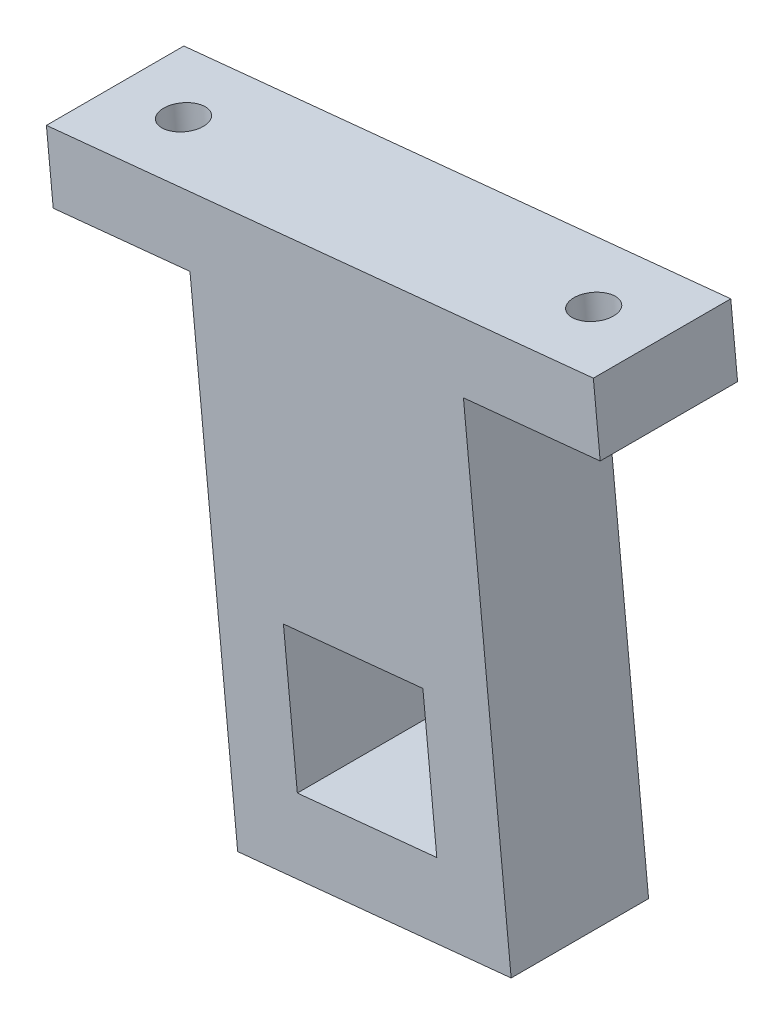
from build123d import *

# Parameters (mm, degrees)
BOSS_EXTRUDE1_DEPTH                                  = 10
CSK_FOR_M2_5_COUNTERSUNK_FLAT_HEAD_SCREW_D           = 2.9
CSK_FOR_M2_5_COUNTERSUNK_FLAT_HEAD_SCREW_CSINK_D     = 5.5
CSK_FOR_M2_5_COUNTERSUNK_FLAT_HEAD_SCREW_CSINK_ANGLE = 90


with BuildPart() as part:
    # Sketch1 → Boss-Extrude1 (new body)
    with BuildSketch(Plane.XY):
        Polygon((114.285524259, -158.659303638), (114.781701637, -163.634623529), (104.831061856, -164.626978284), (108.304303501, -199.454217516), (88.40302394, -201.438927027), (84.929782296, -166.611687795), (74.979142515, -167.604042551), (74.482965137, -162.628722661), align=None)
        Polygon((102.892618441, -194.567125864), (101.88041659, -184.417473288), (91.730764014, -185.429675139), (92.742965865, -195.579327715), align=None, mode=Mode.SUBTRACT)
    extrude(amount=BOSS_EXTRUDE1_DEPTH)

    # CSK for M2.5 Countersunk Flat Head Screw (through all)
    with Locations(Plane(origin=(17.288540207, -173.357395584, 0), x_dir=(-0.9950639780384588, -0.09923547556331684, 0), z_dir=(0.09923547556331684, -0.9950639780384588, 0))):
        with Locations((-62.976776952, -5), (-92.976776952, -5)):
            CounterSinkHole(CSK_FOR_M2_5_COUNTERSUNK_FLAT_HEAD_SCREW_D / 2, CSK_FOR_M2_5_COUNTERSUNK_FLAT_HEAD_SCREW_CSINK_D / 2, counter_sink_angle=CSK_FOR_M2_5_COUNTERSUNK_FLAT_HEAD_SCREW_CSINK_ANGLE)


solid = part.part
